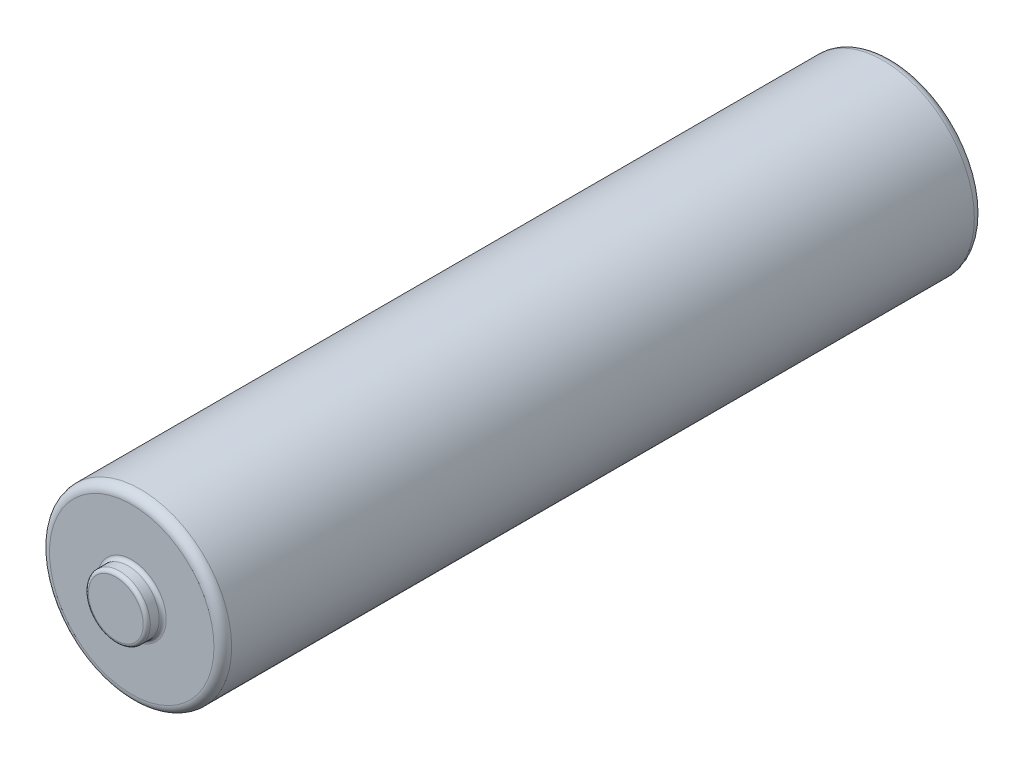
from build123d import *

# Parameters (mm, degrees)
ESQUISSE1_R             = 5.15
EXTRUSION1_DEPTH        = 43
ESQUISSE2_R             = 1.75
EXTRUSION2_DEPTH        = 0.9
CONG_1_R                = 0.2
CONG_2_R                = 0.5
ESQUISSE3_R             = 4
ESQUISSE3_R_2           = 3
ENL_V_MAT_EXTRU_1_DEPTH = 0.1
CONG_3_R                = 0.05


with BuildPart() as part:
    # Esquisse1 → Extrusion1 (new body)
    with BuildSketch(Plane.XY):
        Circle(ESQUISSE1_R)
    extrude(amount=EXTRUSION1_DEPTH)

    # Esquisse2 → Extrusion2 (add)
    with BuildSketch(Plane.XY.offset(43)):
        Circle(ESQUISSE2_R)
    extrude(amount=EXTRUSION2_DEPTH)

    # Cong_1
    cong_1_edges = [part.edges().sort_by_distance(p)[0] for p in [
        (-1.75, 0, 43),
        (-1.75, 0, 43.9),
    ]]
    fillet(cong_1_edges, radius=CONG_1_R)

    # Cong_2
    cong_2_edges = [part.edges().sort_by_distance(p)[0] for p in [
        (-5.15, 0, 0),
        (-5.15, 0, 43),
    ]]
    fillet(cong_2_edges, radius=CONG_2_R)

    # Esquisse3 → Enl_v. mat.-Extru.1 (cut)
    with BuildSketch(Plane(origin=(0, 0, 0), x_dir=(-1, 0, 0), z_dir=(0, 0, -1))):
        Circle(ESQUISSE3_R)
        Circle(ESQUISSE3_R_2, mode=Mode.SUBTRACT)
    extrude(amount=-ENL_V_MAT_EXTRU_1_DEPTH, mode=Mode.SUBTRACT)

    # Cong_3
    cong_3_edges = [part.edges().sort_by_distance(p)[0] for p in [
        (4, 0, 0.1),
        (3, 0, 0.1),
    ]]
    fillet(cong_3_edges, radius=CONG_3_R)


solid = part.part
